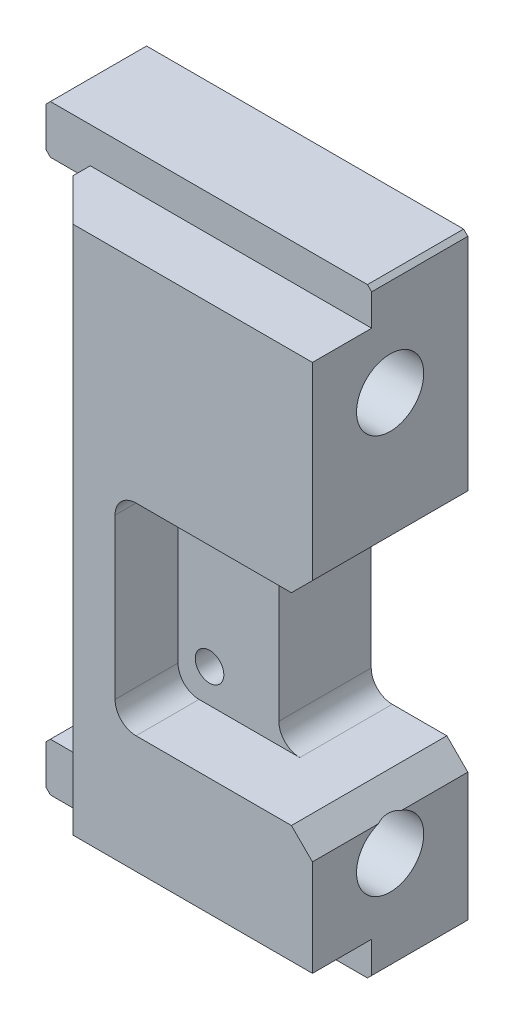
from build123d import *

# Parameters (mm, degrees)
BOSS_EXTRU_1_DEPTH                = 37
ENL_V_MAT_EXTRU_1_DEPTH           = 15
CHANFREIN1_SIZE                   = 10
TROU_TARAUD_M81_D                 = 6.8
TROU_TARAUD_M81_DEPTH             = 22.25
TROU_TARAUD_M81_TIP               = 2.042926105
ESQUISSE7_W                       = 80.352828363
ESQUISSE7_H                       = 15.760829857
ESQUISSE7_W_2                     = 97.138779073
ESQUISSE7_H_2                     = 23.64535608
ENL_V_MAT_EXTRU_2_DEPTH           = 14.1
DIAM_TRE_DU_PER_AGE_8_0_8_1_D     = 8
DIAM_TRE_DU_PER_AGE_8_0_8_1_DEPTH = 38
DIAM_TRE_DU_PER_AGE_8_0_8_1_TIP   = 2.403442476
ESQUISSE4_R                       = 8
ENL_V_MAT_EXTRU_3_DEPTH           = 35
ENL_V_MAT_EXTRU_4_DEPTH           = 354.935929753


with BuildPart() as part:
    # Esquisse2 → Boss.-Extru.1 (new body)
    with BuildSketch(Plane.XY):
        with BuildLine():
            Line((-314.786631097, 295.874050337), (-314.786631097, 175.874050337))
            Line((-314.786631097, 175.874050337), (-324.286631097, 175.874050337))
            Line((-324.286631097, 175.874050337), (-325.286631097, 174.874050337))
            Line((-325.286631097, 174.874050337), (-325.286631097, 165.374050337))
            Line((-325.286631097, 165.374050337), (-324.286631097, 164.374050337))
            Line((-324.286631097, 164.374050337), (-248.786631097, 164.374050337))
            Line((-248.786631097, 164.374050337), (-247.786631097, 165.374050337))
            Line((-247.786631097, 165.374050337), (-247.786631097, 195.874050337))
            Line((-247.786631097, 195.874050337), (-252.786631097, 200.874050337))
            Line((-252.786631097, 200.874050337), (-265.786631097, 200.874050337))
            ThreePointArc((-265.786631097, 200.874050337), (-269.322165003, 202.338516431), (-270.786631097, 205.874050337))
            Line((-270.786631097, 205.874050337), (-270.786631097, 243.874050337))
            ThreePointArc((-270.786631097, 243.874050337), (-269.322165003, 247.409584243), (-265.786631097, 248.874050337))
            Line((-265.786631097, 248.874050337), (-252.786631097, 248.874050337))
            Line((-252.786631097, 248.874050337), (-247.786631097, 253.874050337))
            Line((-247.786631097, 253.874050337), (-247.786631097, 306.374050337))
            Line((-247.786631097, 306.374050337), (-248.786631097, 307.374050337))
            Line((-248.786631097, 307.374050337), (-324.286631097, 307.374050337))
            Line((-324.286631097, 307.374050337), (-325.286631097, 306.374050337))
            Line((-325.286631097, 306.374050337), (-325.286631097, 296.874050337))
            Line((-325.286631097, 296.874050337), (-324.286631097, 295.874050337))
            Line((-324.286631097, 295.874050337), (-314.786631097, 295.874050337))
        make_face()
    extrude(amount=BOSS_EXTRU_1_DEPTH)

    # Esquisse3 → Enl_v. mat.-Extru.1 (cut)
    with BuildSketch(Plane.XY.offset(37)):
        with BuildLine():
            Line((-265.786631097, 248.874050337), (-289.786631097, 248.874050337))
            ThreePointArc((-289.786631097, 248.874050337), (-293.322165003, 247.409584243), (-294.786631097, 243.874050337))
            Line((-294.786631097, 243.874050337), (-294.786631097, 205.874050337))
            ThreePointArc((-294.786631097, 205.874050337), (-293.322165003, 202.338516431), (-289.786631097, 200.874050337))
            Line((-289.786631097, 200.874050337), (-274.786631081, 200.874050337))
            Line((-274.786631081, 200.874050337), (-265.786631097, 200.874050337))
            Line((-265.786631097, 200.874050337), (-265.786631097, 248.874050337))
        make_face()
    extrude(amount=-ENL_V_MAT_EXTRU_1_DEPTH, mode=Mode.SUBTRACT)

    # Chanfrein1
    chanfrein1_edges = [part.edges().sort_by_distance(p)[0] for p in [
        (-314.786631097, 235.874050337, 37),
    ]]
    chamfer(chanfrein1_edges, length=CHANFREIN1_SIZE)

    # Trou taraud_ M81
    with Locations(Plane.XY.offset(22)):
        with Locations((-287.286631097, 240.874050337), (-287.286631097, 208.874050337)):
            Hole(TROU_TARAUD_M81_D / 2, depth=TROU_TARAUD_M81_DEPTH)
            with Locations((0, 0, -(TROU_TARAUD_M81_DEPTH + TROU_TARAUD_M81_TIP / 2))):  # 118° drill point
                Cone(0, TROU_TARAUD_M81_D / 2, TROU_TARAUD_M81_TIP, mode=Mode.SUBTRACT)

    # Esquisse7 → Enl_v. mat.-Extru.2 (cut)
    with BuildSketch(Plane.XY.offset(37)):
        with Locations((-287.963045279, 306.754465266)):
            Rectangle(ESQUISSE7_W, ESQUISSE7_H)
        with Locations((-296.356020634, 161.051372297)):
            Rectangle(ESQUISSE7_W_2, ESQUISSE7_H_2)
    extrude(amount=-ENL_V_MAT_EXTRU_2_DEPTH, mode=Mode.SUBTRACT)

    # Diam_tre du per_age _8.0 _8_1
    with Locations(Plane(origin=(-247.786631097, 0, 0), x_dir=(0, 0, -1), z_dir=(1, 0, 0))):
        with Locations((-18.5, 188.374050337), (-18.5, 283.374050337)):
            Hole(DIAM_TRE_DU_PER_AGE_8_0_8_1_D / 2, depth=DIAM_TRE_DU_PER_AGE_8_0_8_1_DEPTH)
            with Locations((0, 0, -(DIAM_TRE_DU_PER_AGE_8_0_8_1_DEPTH + DIAM_TRE_DU_PER_AGE_8_0_8_1_TIP / 2))):  # 118° drill point
                Cone(0, DIAM_TRE_DU_PER_AGE_8_0_8_1_D / 2, DIAM_TRE_DU_PER_AGE_8_0_8_1_TIP, mode=Mode.SUBTRACT)

    # Esquisse4 → Enl_v. mat.-Extru.3 (cut)
    with BuildSketch(Plane(origin=(-247.786631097, 0, 0), x_dir=(0, 0, -1), z_dir=(1, 0, 0))):
        with Locations((-18.5, 283.374050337)):
            Circle(ESQUISSE4_R)
        with Locations((-18.5, 188.374050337)):
            Circle(ESQUISSE4_R)
    extrude(amount=-ENL_V_MAT_EXTRU_3_DEPTH, mode=Mode.SUBTRACT)

    # Esquisse8 → Enl_v. mat.-Extru.4 (cut, through all)
    with BuildSketch(Plane.XZ.offset(-172.874050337)):
        Polygon((-304.786631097, 37), (-314.786631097, 27), (-314.786631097, 22.9), (-325.286631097, 22.9), (-325.286631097, 37), align=None)
    extrude(amount=-ENL_V_MAT_EXTRU_4_DEPTH, mode=Mode.SUBTRACT)


solid = part.part
